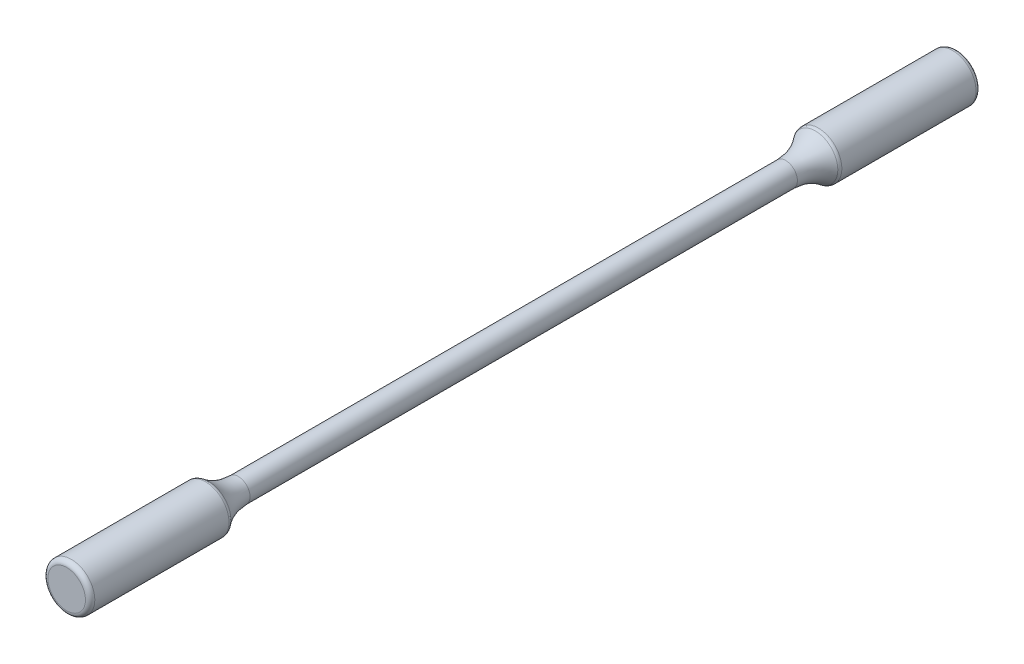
ISO-10303-21;
HEADER;
FILE_DESCRIPTION(('STEP AP214'),'2;1');
FILE_NAME('part.step','',(''),(''),'','','');
FILE_SCHEMA(('AUTOMOTIVE_DESIGN { 1 0 10303 214 1 1 1 1 }'));
ENDSEC;
DATA;
#1=APPLICATION_CONTEXT('core data for automotive mechanical design processes');
#2=APPLICATION_PROTOCOL_DEFINITION('international standard','automotive_design',2000,#1);
#3=PRODUCT_CONTEXT('',#1,'mechanical');
#4=PRODUCT('Part','Part','',(#3));
#5=PRODUCT_RELATED_PRODUCT_CATEGORY('part','',(#4));
#6=PRODUCT_DEFINITION_FORMATION('','',#4);
#7=PRODUCT_DEFINITION_CONTEXT('part definition',#1,'design');
#8=PRODUCT_DEFINITION('design','',#6,#7);
#9=PRODUCT_DEFINITION_SHAPE('','',#8);
#10=(LENGTH_UNIT() NAMED_UNIT(*) SI_UNIT(.MILLI.,.METRE.));
#11=(NAMED_UNIT(*) PLANE_ANGLE_UNIT() SI_UNIT($,.RADIAN.));
#12=(NAMED_UNIT(*) SI_UNIT($,.STERADIAN.) SOLID_ANGLE_UNIT());
#13=UNCERTAINTY_MEASURE_WITH_UNIT(LENGTH_MEASURE(1.E-05),#10,'distance_accuracy_value','');
#14=(GEOMETRIC_REPRESENTATION_CONTEXT(3) GLOBAL_UNCERTAINTY_ASSIGNED_CONTEXT((#13)) GLOBAL_UNIT_ASSIGNED_CONTEXT((#10,
#11,#12)) REPRESENTATION_CONTEXT('',''));
#15=CARTESIAN_POINT('',(0.,0.,0.));
#16=DIRECTION('',(0.,0.,1.));
#17=DIRECTION('',(1.,0.,0.));
#18=AXIS2_PLACEMENT_3D('',#15,#16,#17);
#19=CARTESIAN_POINT('',(0.,0.,130.));
#20=DIRECTION('',(0.,0.,-1.));
#21=DIRECTION('',(-1.,0.,0.));
#22=AXIS2_PLACEMENT_3D('',#19,#20,#21);
#23=CYLINDRICAL_SURFACE('',#22,2.5);
#24=CARTESIAN_POINT('',(0.,0.,6.61437827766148));
#25=DIRECTION('',(0.,0.,-1.));
#26=DIRECTION('',(-1.,0.,0.));
#27=AXIS2_PLACEMENT_3D('',#24,#25,#26);
#28=CIRCLE('',#27,2.5);
#29=CARTESIAN_POINT('',(-2.5,0.,6.61437827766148));
#30=VERTEX_POINT('',#29);
#31=EDGE_CURVE('E71',#30,#30,#28,.F.);
#32=ORIENTED_EDGE('',*,*,#31,.T.);
#33=EDGE_LOOP('',(#32));
#34=FACE_BOUND('',#33,.T.);
#35=CARTESIAN_POINT('',(0.,0.,123.385621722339));
#36=DIRECTION('',(0.,0.,1.));
#37=DIRECTION('',(1.,0.,0.));
#38=AXIS2_PLACEMENT_3D('',#35,#36,#37);
#39=CIRCLE('',#38,2.5);
#40=CARTESIAN_POINT('',(2.5,0.,123.385621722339));
#41=VERTEX_POINT('',#40);
#42=EDGE_CURVE('E74',#41,#41,#39,.F.);
#43=ORIENTED_EDGE('',*,*,#42,.T.);
#44=EDGE_LOOP('',(#43));
#45=FACE_BOUND('',#44,.T.);
#46=ADVANCED_FACE('F39',(#34,#45),#23,.T.);
#47=CARTESIAN_POINT('',(0.,0.,160.));
#48=DIRECTION('',(0.,0.,-1.));
#49=DIRECTION('',(-1.,0.,0.));
#50=AXIS2_PLACEMENT_3D('',#47,#48,#49);
#51=CYLINDRICAL_SURFACE('',#50,5.);
#52=CARTESIAN_POINT('',(0.,0.,130.367741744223));
#53=DIRECTION('',(0.,0.,-1.));
#54=DIRECTION('',(-1.,0.,0.));
#55=AXIS2_PLACEMENT_3D('',#52,#53,#54);
#56=CIRCLE('',#55,5.);
#57=CARTESIAN_POINT('',(-5.,0.,130.367741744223));
#58=VERTEX_POINT('',#57);
#59=EDGE_CURVE('E46',#58,#58,#56,.F.);
#60=ORIENTED_EDGE('',*,*,#59,.T.);
#61=EDGE_LOOP('',(#60));
#62=FACE_BOUND('',#61,.T.);
#63=CARTESIAN_POINT('',(0.,0.,159.));
#64=DIRECTION('',(0.,0.,1.));
#65=DIRECTION('',(1.,0.,0.));
#66=AXIS2_PLACEMENT_3D('',#63,#64,#65);
#67=CIRCLE('',#66,5.);
#68=CARTESIAN_POINT('',(5.,0.,159.));
#69=VERTEX_POINT('',#68);
#70=EDGE_CURVE('E59',#69,#69,#67,.F.);
#71=ORIENTED_EDGE('',*,*,#70,.T.);
#72=EDGE_LOOP('',(#71));
#73=FACE_BOUND('',#72,.T.);
#74=ADVANCED_FACE('F95',(#62,#73),#51,.T.);
#75=CARTESIAN_POINT('',(0.,0.,160.));
#76=DIRECTION('',(0.,0.,1.));
#77=DIRECTION('',(1.,0.,0.));
#78=AXIS2_PLACEMENT_3D('',#75,#76,#77);
#79=PLANE('',#78);
#80=CARTESIAN_POINT('',(0.,0.,160.));
#81=DIRECTION('',(0.,0.,1.));
#82=DIRECTION('',(1.,0.,0.));
#83=AXIS2_PLACEMENT_3D('',#80,#81,#82);
#84=CIRCLE('',#83,4.);
#85=CARTESIAN_POINT('',(4.,0.,160.));
#86=VERTEX_POINT('',#85);
#87=EDGE_CURVE('E62',#86,#86,#84,.T.);
#88=ORIENTED_EDGE('',*,*,#87,.T.);
#89=EDGE_LOOP('',(#88));
#90=FACE_BOUND('',#89,.T.);
#91=ADVANCED_FACE('F101',(#90),#79,.T.);
#92=CARTESIAN_POINT('',(0.,0.,-30.));
#93=DIRECTION('',(0.,0.,1.));
#94=DIRECTION('',(1.,0.,0.));
#95=AXIS2_PLACEMENT_3D('',#92,#93,#94);
#96=CYLINDRICAL_SURFACE('',#95,5.);
#97=CARTESIAN_POINT('',(0.,0.,-0.367741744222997));
#98=DIRECTION('',(0.,0.,1.));
#99=DIRECTION('',(1.,0.,0.));
#100=AXIS2_PLACEMENT_3D('',#97,#98,#99);
#101=CIRCLE('',#100,5.);
#102=CARTESIAN_POINT('',(5.,0.,-0.367741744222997));
#103=VERTEX_POINT('',#102);
#104=EDGE_CURVE('E54',#103,#103,#101,.F.);
#105=ORIENTED_EDGE('',*,*,#104,.T.);
#106=EDGE_LOOP('',(#105));
#107=FACE_BOUND('',#106,.T.);
#108=CARTESIAN_POINT('',(0.,0.,-29.));
#109=DIRECTION('',(0.,0.,-1.));
#110=DIRECTION('',(-1.,0.,0.));
#111=AXIS2_PLACEMENT_3D('',#108,#109,#110);
#112=CIRCLE('',#111,5.);
#113=CARTESIAN_POINT('',(-5.,0.,-29.));
#114=VERTEX_POINT('',#113);
#115=EDGE_CURVE('E65',#114,#114,#112,.F.);
#116=ORIENTED_EDGE('',*,*,#115,.T.);
#117=EDGE_LOOP('',(#116));
#118=FACE_BOUND('',#117,.T.);
#119=ADVANCED_FACE('F106',(#107,#118),#96,.T.);
#120=CARTESIAN_POINT('',(0.,0.,-30.));
#121=DIRECTION('',(0.,0.,-1.));
#122=DIRECTION('',(-1.,0.,0.));
#123=AXIS2_PLACEMENT_3D('',#120,#121,#122);
#124=PLANE('',#123);
#125=CARTESIAN_POINT('',(0.,0.,-30.));
#126=DIRECTION('',(0.,0.,-1.));
#127=DIRECTION('',(-1.,0.,0.));
#128=AXIS2_PLACEMENT_3D('',#125,#126,#127);
#129=CIRCLE('',#128,4.);
#130=CARTESIAN_POINT('',(-4.,0.,-30.));
#131=VERTEX_POINT('',#130);
#132=EDGE_CURVE('E68',#131,#131,#129,.T.);
#133=ORIENTED_EDGE('',*,*,#132,.T.);
#134=EDGE_LOOP('',(#133));
#135=FACE_BOUND('',#134,.T.);
#136=ADVANCED_FACE('F91',(#135),#124,.T.);
#137=CARTESIAN_POINT('',(0.,0.,6.61437827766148));
#138=DIRECTION('',(0.,0.,-1.));
#139=DIRECTION('',(-1.,0.,0.));
#140=AXIS2_PLACEMENT_3D('',#137,#138,#139);
#141=TOROIDAL_SURFACE('',#140,12.5,10.);
#142=CARTESIAN_POINT('',(0.,0.,0.266996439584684));
#143=DIRECTION('',(0.,0.,1.));
#144=DIRECTION('',(1.,0.,0.));
#145=AXIS2_PLACEMENT_3D('',#142,#143,#144);
#146=CIRCLE('',#145,4.77272727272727);
#147=CARTESIAN_POINT('',(4.77272727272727,0.,0.266996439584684));
#148=VERTEX_POINT('',#147);
#149=EDGE_CURVE('E50',#148,#148,#146,.T.);
#150=ORIENTED_EDGE('',*,*,#149,.T.);
#151=EDGE_LOOP('',(#150));
#152=FACE_BOUND('',#151,.T.);
#153=ORIENTED_EDGE('',*,*,#31,.F.);
#154=EDGE_LOOP('',(#153));
#155=FACE_BOUND('',#154,.T.);
#156=ADVANCED_FACE('F82',(#152,#155),#141,.F.);
#157=CARTESIAN_POINT('',(0.,0.,123.385621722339));
#158=DIRECTION('',(0.,0.,1.));
#159=DIRECTION('',(1.,0.,0.));
#160=AXIS2_PLACEMENT_3D('',#157,#158,#159);
#161=TOROIDAL_SURFACE('',#160,12.5,10.);
#162=CARTESIAN_POINT('',(0.,0.,129.733003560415));
#163=DIRECTION('',(0.,0.,-1.));
#164=DIRECTION('',(-1.,0.,0.));
#165=AXIS2_PLACEMENT_3D('',#162,#163,#164);
#166=CIRCLE('',#165,4.77272727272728);
#167=CARTESIAN_POINT('',(-4.77272727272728,0.,129.733003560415));
#168=VERTEX_POINT('',#167);
#169=EDGE_CURVE('E10',#168,#168,#166,.T.);
#170=ORIENTED_EDGE('',*,*,#169,.T.);
#171=EDGE_LOOP('',(#170));
#172=FACE_BOUND('',#171,.T.);
#173=ORIENTED_EDGE('',*,*,#42,.F.);
#174=EDGE_LOOP('',(#173));
#175=FACE_BOUND('',#174,.T.);
#176=ADVANCED_FACE('F79',(#172,#175),#161,.F.);
#177=CARTESIAN_POINT('',(0.,0.,-29.));
#178=DIRECTION('',(0.,0.,-1.));
#179=DIRECTION('',(-1.,0.,0.));
#180=AXIS2_PLACEMENT_3D('',#177,#178,#179);
#181=TOROIDAL_SURFACE('',#180,4.,1.);
#182=ORIENTED_EDGE('',*,*,#115,.F.);
#183=EDGE_LOOP('',(#182));
#184=FACE_BOUND('',#183,.T.);
#185=ORIENTED_EDGE('',*,*,#132,.F.);
#186=EDGE_LOOP('',(#185));
#187=FACE_BOUND('',#186,.T.);
#188=ADVANCED_FACE('F81',(#184,#187),#181,.T.);
#189=CARTESIAN_POINT('',(0.,0.,159.));
#190=DIRECTION('',(0.,0.,1.));
#191=DIRECTION('',(1.,0.,0.));
#192=AXIS2_PLACEMENT_3D('',#189,#190,#191);
#193=TOROIDAL_SURFACE('',#192,4.,1.);
#194=ORIENTED_EDGE('',*,*,#70,.F.);
#195=EDGE_LOOP('',(#194));
#196=FACE_BOUND('',#195,.T.);
#197=ORIENTED_EDGE('',*,*,#87,.F.);
#198=EDGE_LOOP('',(#197));
#199=FACE_BOUND('',#198,.T.);
#200=ADVANCED_FACE('F88',(#196,#199),#193,.T.);
#201=CARTESIAN_POINT('',(0.,0.,-0.367741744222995));
#202=DIRECTION('',(0.,0.,1.));
#203=DIRECTION('',(1.,0.,0.));
#204=AXIS2_PLACEMENT_3D('',#201,#202,#203);
#205=TOROIDAL_SURFACE('',#204,4.,1.);
#206=ORIENTED_EDGE('',*,*,#149,.F.);
#207=EDGE_LOOP('',(#206));
#208=FACE_BOUND('',#207,.T.);
#209=ORIENTED_EDGE('',*,*,#104,.F.);
#210=EDGE_LOOP('',(#209));
#211=FACE_BOUND('',#210,.T.);
#212=ADVANCED_FACE('F140',(#208,#211),#205,.T.);
#213=CARTESIAN_POINT('',(0.,0.,130.367741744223));
#214=DIRECTION('',(0.,0.,-1.));
#215=DIRECTION('',(-1.,0.,0.));
#216=AXIS2_PLACEMENT_3D('',#213,#214,#215);
#217=TOROIDAL_SURFACE('',#216,4.,1.);
#218=ORIENTED_EDGE('',*,*,#169,.F.);
#219=EDGE_LOOP('',(#218));
#220=FACE_BOUND('',#219,.T.);
#221=ORIENTED_EDGE('',*,*,#59,.F.);
#222=EDGE_LOOP('',(#221));
#223=FACE_BOUND('',#222,.T.);
#224=ADVANCED_FACE('F41',(#220,#223),#217,.T.);
#225=CLOSED_SHELL('',(#46,#74,#91,#119,#136,#156,#176,#188,#200,#212,#224));
#226=MANIFOLD_SOLID_BREP('B2',#225);
#227=ADVANCED_BREP_SHAPE_REPRESENTATION('',(#18,#226),#14);
#228=SHAPE_DEFINITION_REPRESENTATION(#9,#227);
ENDSEC;
END-ISO-10303-21;
